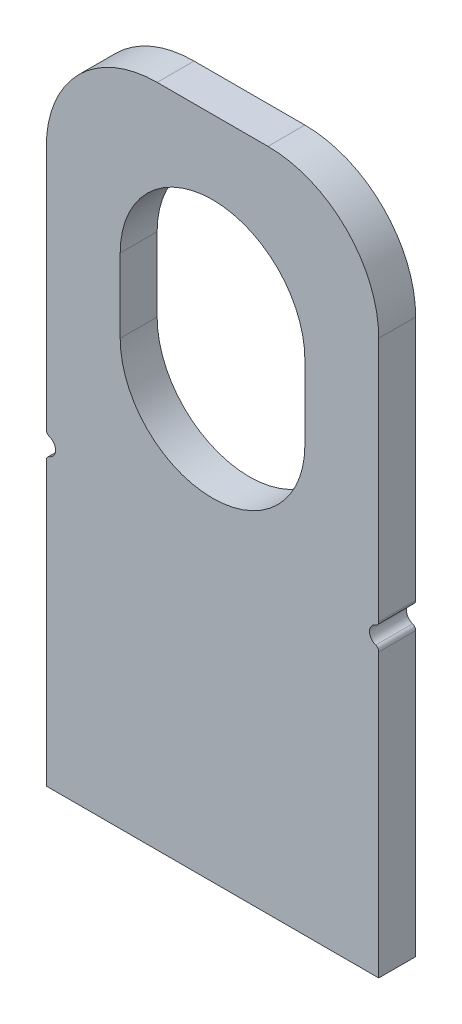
from build123d import *

# Parameters (mm, degrees)
EXTRUDE1_DEPTH = 12.7


with BuildPart() as part:
    # Sketch1 → Extrude1 (new body)
    with BuildSketch(Plane.XY):
        with BuildLine():
            Line((57.15, 106.090128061), (57.15, 190.5))
            ThreePointArc((57.15, 190.5), (45.990768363, 217.440768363), (19.05, 228.6))
            Line((19.05, 228.6), (-19.05, 228.6))
            ThreePointArc((-19.05, 228.6), (-45.990768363, 217.440768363), (-57.15, 190.5))
            Line((-57.15, 190.5), (-57.15, 106.090128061))
            ThreePointArc((-57.15, 106.090128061), (-56.858688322, 105.173584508), (-56.091666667, 104.593418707))
            ThreePointArc((-56.091666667, 104.593418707), (-53.975, 101.6), (-56.091666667, 98.606581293))
            ThreePointArc((-56.091666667, 98.606581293), (-56.858688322, 98.026415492), (-57.15, 97.109871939))
            Line((-57.15, 97.109871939), (-57.15, 0))
            Line((-57.15, 0), (57.15, 0))
            Line((57.15, 0), (57.15, 97.109871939))
            ThreePointArc((57.15, 97.109871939), (56.858688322, 98.026415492), (56.091666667, 98.606581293))
            ThreePointArc((56.091666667, 98.606581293), (53.975, 101.6), (56.091666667, 104.593418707))
            ThreePointArc((56.091666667, 104.593418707), (56.858688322, 105.173584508), (57.15, 106.090128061))
        make_face()
        with BuildLine():
            Line((31.75, 146.05), (31.75, 171.45))
            ThreePointArc((31.75, 171.45), (0, 203.2), (-31.75, 171.45))
            Line((-31.75, 171.45), (-31.75, 146.05))
            ThreePointArc((-31.75, 146.05), (0, 114.3), (31.75, 146.05))
        make_face(mode=Mode.SUBTRACT)
    extrude(amount=EXTRUDE1_DEPTH)


solid = part.part
